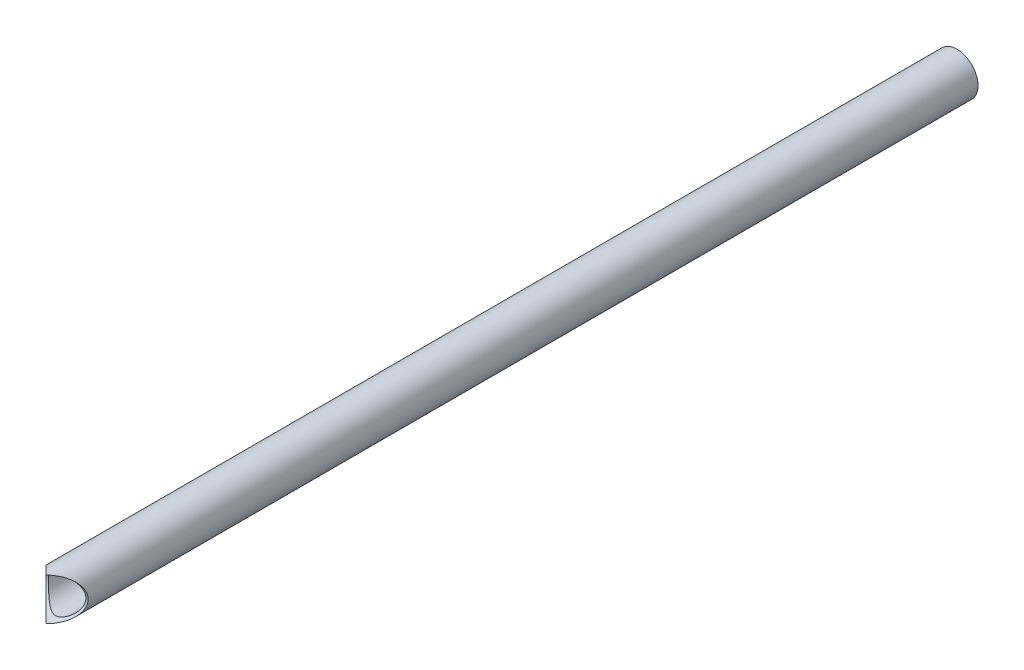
ISO-10303-21;
HEADER;
FILE_DESCRIPTION(('STEP AP214'),'2;1');
FILE_NAME('part.step','',(''),(''),'','','');
FILE_SCHEMA(('AUTOMOTIVE_DESIGN { 1 0 10303 214 1 1 1 1 }'));
ENDSEC;
DATA;
#1=APPLICATION_CONTEXT('core data for automotive mechanical design processes');
#2=APPLICATION_PROTOCOL_DEFINITION('international standard','automotive_design',2000,#1);
#3=PRODUCT_CONTEXT('',#1,'mechanical');
#4=PRODUCT('Part','Part','',(#3));
#5=PRODUCT_RELATED_PRODUCT_CATEGORY('part','',(#4));
#6=PRODUCT_DEFINITION_FORMATION('','',#4);
#7=PRODUCT_DEFINITION_CONTEXT('part definition',#1,'design');
#8=PRODUCT_DEFINITION('design','',#6,#7);
#9=PRODUCT_DEFINITION_SHAPE('','',#8);
#10=(LENGTH_UNIT() NAMED_UNIT(*) SI_UNIT(.MILLI.,.METRE.));
#11=(NAMED_UNIT(*) PLANE_ANGLE_UNIT() SI_UNIT($,.RADIAN.));
#12=(NAMED_UNIT(*) SI_UNIT($,.STERADIAN.) SOLID_ANGLE_UNIT());
#13=UNCERTAINTY_MEASURE_WITH_UNIT(LENGTH_MEASURE(1.E-05),#10,'distance_accuracy_value','');
#14=(GEOMETRIC_REPRESENTATION_CONTEXT(3) GLOBAL_UNCERTAINTY_ASSIGNED_CONTEXT((#13)) GLOBAL_UNIT_ASSIGNED_CONTEXT((#10,
#11,#12)) REPRESENTATION_CONTEXT('',''));
#15=CARTESIAN_POINT('',(0.,0.,0.));
#16=DIRECTION('',(0.,0.,1.));
#17=DIRECTION('',(1.,0.,0.));
#18=AXIS2_PLACEMENT_3D('',#15,#16,#17);
#19=CARTESIAN_POINT('',(-193.,0.,-531.999));
#20=DIRECTION('',(0.,0.,-1.));
#21=DIRECTION('',(-1.,0.,0.));
#22=AXIS2_PLACEMENT_3D('',#19,#20,#21);
#23=CYLINDRICAL_SURFACE('',#22,14.);
#24=CARTESIAN_POINT('',(-193.,0.,-546.));
#25=DIRECTION('',(0.707106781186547,0.,-0.707106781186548));
#26=DIRECTION('',(-0.707106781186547,0.,-0.707106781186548));
#27=AXIS2_PLACEMENT_3D('',#24,#25,#26);
#28=ELLIPSE('',#27,19.7989898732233,14.);
#29=CARTESIAN_POINT('',(-193.,14.,-546.));
#30=VERTEX_POINT('',#29);
#31=CARTESIAN_POINT('',(-193.,-14.,-546.));
#32=VERTEX_POINT('',#31);
#33=EDGE_CURVE('E42',#30,#32,#28,.F.);
#34=ORIENTED_EDGE('',*,*,#33,.F.);
#35=CARTESIAN_POINT('',(-193.,0.,-546.));
#36=DIRECTION('',(-0.707106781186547,0.,-0.707106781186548));
#37=DIRECTION('',(0.707106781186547,0.,-0.707106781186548));
#38=AXIS2_PLACEMENT_3D('',#35,#36,#37);
#39=ELLIPSE('',#38,19.7989898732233,14.);
#40=EDGE_CURVE('E11',#32,#30,#39,.F.);
#41=ORIENTED_EDGE('',*,*,#40,.F.);
#42=EDGE_LOOP('',(#34,#41));
#43=FACE_BOUND('',#42,.T.);
#44=CARTESIAN_POINT('',(-193.,0.,-1151.));
#45=DIRECTION('',(0.,0.,-1.));
#46=DIRECTION('',(-1.,0.,0.));
#47=AXIS2_PLACEMENT_3D('',#44,#45,#46);
#48=CIRCLE('',#47,14.);
#49=CARTESIAN_POINT('',(-207.,0.,-1151.));
#50=VERTEX_POINT('',#49);
#51=EDGE_CURVE('E55',#50,#50,#48,.T.);
#52=ORIENTED_EDGE('',*,*,#51,.F.);
#53=EDGE_LOOP('',(#52));
#54=FACE_BOUND('',#53,.T.);
#55=ADVANCED_FACE('F32',(#43,#54),#23,.T.);
#56=CARTESIAN_POINT('',(-193.,0.,-531.999));
#57=DIRECTION('',(0.,0.,-1.));
#58=DIRECTION('',(-1.,0.,0.));
#59=AXIS2_PLACEMENT_3D('',#56,#57,#58);
#60=CYLINDRICAL_SURFACE('',#59,12.5);
#61=CARTESIAN_POINT('',(-205.5,0.,-560.));
#62=CARTESIAN_POINT('',(-205.500002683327,-0.290426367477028,-560.000002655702));
#63=CARTESIAN_POINT('',(-205.489862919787,-0.580822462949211,-559.990946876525));
#64=CARTESIAN_POINT('',(-205.449509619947,-1.15920550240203,-559.954934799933));
#65=CARTESIAN_POINT('',(-205.419289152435,-1.44719157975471,-559.927972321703));
#66=CARTESIAN_POINT('',(-205.339308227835,-2.01862087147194,-559.856702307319));
#67=CARTESIAN_POINT('',(-205.289522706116,-2.30205777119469,-559.812372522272));
#68=CARTESIAN_POINT('',(-205.171338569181,-2.86188119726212,-559.707324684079));
#69=CARTESIAN_POINT('',(-205.102941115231,-3.13826816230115,-559.646607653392));
#70=CARTESIAN_POINT('',(-204.949197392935,-3.68042940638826,-559.51044238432));
#71=CARTESIAN_POINT('',(-204.863967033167,-3.94626210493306,-559.435094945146));
#72=CARTESIAN_POINT('',(-204.677532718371,-4.46788012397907,-559.270751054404));
#73=CARTESIAN_POINT('',(-204.576328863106,-4.72366550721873,-559.181754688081));
#74=CARTESIAN_POINT('',(-204.359240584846,-5.22418119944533,-558.991520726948));
#75=CARTESIAN_POINT('',(-204.243356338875,-5.46891164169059,-558.890283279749));
#76=CARTESIAN_POINT('',(-203.998151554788,-5.94666222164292,-558.676974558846));
#77=CARTESIAN_POINT('',(-203.868828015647,-6.17967972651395,-558.564900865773));
#78=CARTESIAN_POINT('',(-203.544530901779,-6.72299041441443,-558.285274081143));
#79=CARTESIAN_POINT('',(-203.343767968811,-7.02755432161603,-558.113260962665));
#80=CARTESIAN_POINT('',(-202.921214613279,-7.61247576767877,-557.754489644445));
#81=CARTESIAN_POINT('',(-202.69941650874,-7.89282439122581,-557.567726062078));
#82=CARTESIAN_POINT('',(-202.236586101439,-8.4297919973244,-557.182487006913));
#83=CARTESIAN_POINT('',(-201.995512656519,-8.68635755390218,-556.983986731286));
#84=CARTESIAN_POINT('',(-201.49627804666,-9.17525653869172,-556.579008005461));
#85=CARTESIAN_POINT('',(-201.238119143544,-9.40759316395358,-556.372530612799));
#86=CARTESIAN_POINT('',(-200.699647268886,-9.85344692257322,-555.950175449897));
#87=CARTESIAN_POINT('',(-200.418963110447,-10.0664134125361,-555.734190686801));
#88=CARTESIAN_POINT('',(-199.841064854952,-10.4677435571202,-555.301260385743));
#89=CARTESIAN_POINT('',(-199.543846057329,-10.6561001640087,-555.084314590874));
#90=CARTESIAN_POINT('',(-198.933038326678,-11.0078643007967,-554.654700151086));
#91=CARTESIAN_POINT('',(-198.619480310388,-11.1713168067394,-554.44202441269));
#92=CARTESIAN_POINT('',(-197.974194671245,-11.4731979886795,-554.026914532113));
#93=CARTESIAN_POINT('',(-197.642479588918,-11.6116436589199,-553.824473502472));
#94=CARTESIAN_POINT('',(-197.128501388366,-11.7999538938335,-553.534887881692));
#95=CARTESIAN_POINT('',(-196.953925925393,-11.8596381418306,-553.440459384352));
#96=CARTESIAN_POINT('',(-196.599211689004,-11.972065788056,-553.258176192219));
#97=CARTESIAN_POINT('',(-196.419072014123,-12.0248080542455,-553.170322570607));
#98=CARTESIAN_POINT('',(-195.870033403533,-12.1719422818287,-552.919616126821));
#99=CARTESIAN_POINT('',(-195.491918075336,-12.2554639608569,-552.76926709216));
#100=CARTESIAN_POINT('',(-194.940068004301,-12.3496272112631,-552.594710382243));
#101=CARTESIAN_POINT('',(-194.775680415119,-12.3743714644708,-552.548060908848));
#102=CARTESIAN_POINT('',(-194.443364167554,-12.4175173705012,-552.465864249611));
#103=CARTESIAN_POINT('',(-194.275437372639,-12.4359222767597,-552.430311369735));
#104=CARTESIAN_POINT('',(-193.93709541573,-12.4659792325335,-552.371848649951));
#105=CARTESIAN_POINT('',(-193.766685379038,-12.4776435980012,-552.348915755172));
#106=CARTESIAN_POINT('',(-193.424230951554,-12.4939746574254,-552.316718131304));
#107=CARTESIAN_POINT('',(-193.252186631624,-12.4986416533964,-552.307452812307));
#108=CARTESIAN_POINT('',(-192.907247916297,-12.5008499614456,-552.303075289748));
#109=CARTESIAN_POINT('',(-192.734352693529,-12.4983655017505,-552.308014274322));
#110=CARTESIAN_POINT('',(-192.389793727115,-12.4862873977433,-552.331887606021));
#111=CARTESIAN_POINT('',(-192.218130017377,-12.476693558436,-552.35082233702));
#112=CARTESIAN_POINT('',(-191.877005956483,-12.450630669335,-552.401765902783));
#113=CARTESIAN_POINT('',(-191.707549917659,-12.4341497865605,-552.433797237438));
#114=CARTESIAN_POINT('',(-191.372008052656,-12.3946846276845,-552.509501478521));
#115=CARTESIAN_POINT('',(-191.205923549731,-12.3716978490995,-552.553178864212));
#116=CARTESIAN_POINT('',(-190.798152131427,-12.3070190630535,-552.67412751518));
#117=CARTESIAN_POINT('',(-190.558830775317,-12.2616606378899,-552.757421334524));
#118=CARTESIAN_POINT('',(-190.08942426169,-12.1587985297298,-552.940796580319));
#119=CARTESIAN_POINT('',(-189.859344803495,-12.1012874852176,-553.040888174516));
#120=CARTESIAN_POINT('',(-189.407388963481,-11.9749067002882,-553.25375675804));
#121=CARTESIAN_POINT('',(-189.185544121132,-11.9059978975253,-553.366576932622));
#122=CARTESIAN_POINT('',(-188.750297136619,-11.7576734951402,-553.601076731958));
#123=CARTESIAN_POINT('',(-188.536894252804,-11.6782588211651,-553.722755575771));
#124=CARTESIAN_POINT('',(-188.140559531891,-11.5185240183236,-553.958747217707));
#125=CARTESIAN_POINT('',(-187.956832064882,-11.4392350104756,-554.072428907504));
#126=CARTESIAN_POINT('',(-187.595134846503,-11.2728455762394,-554.303205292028));
#127=CARTESIAN_POINT('',(-187.417165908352,-11.1857440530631,-554.420300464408));
#128=CARTESIAN_POINT('',(-186.891240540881,-10.9128047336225,-554.774938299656));
#129=CARTESIAN_POINT('',(-186.551407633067,-10.7153898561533,-555.01574637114));
#130=CARTESIAN_POINT('',(-185.892421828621,-10.2900913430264,-555.498295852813));
#131=CARTESIAN_POINT('',(-185.573262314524,-10.0622175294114,-555.740036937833));
#132=CARTESIAN_POINT('',(-184.955687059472,-9.57566913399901,-556.218755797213));
#133=CARTESIAN_POINT('',(-184.657262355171,-9.31700799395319,-556.455735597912));
#134=CARTESIAN_POINT('',(-184.132840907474,-8.81650601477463,-556.879203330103));
#135=CARTESIAN_POINT('',(-183.903321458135,-8.57967281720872,-557.067256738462));
#136=CARTESIAN_POINT('',(-183.460506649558,-8.08445323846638,-557.434007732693));
#137=CARTESIAN_POINT('',(-183.247211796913,-7.8260661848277,-557.612705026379));
#138=CARTESIAN_POINT('',(-182.838977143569,-7.28816980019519,-557.957612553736));
#139=CARTESIAN_POINT('',(-182.644007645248,-7.0086960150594,-558.123842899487));
#140=CARTESIAN_POINT('',(-182.274259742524,-6.42858608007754,-558.441161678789));
#141=CARTESIAN_POINT('',(-182.099476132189,-6.12795541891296,-558.592254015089));
#142=CARTESIAN_POINT('',(-181.808062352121,-5.57370754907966,-558.845445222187));
#143=CARTESIAN_POINT('',(-181.687034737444,-5.32400446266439,-558.951068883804));
#144=CARTESIAN_POINT('',(-181.460312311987,-4.8128714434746,-559.149577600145));
#145=CARTESIAN_POINT('',(-181.354614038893,-4.55144417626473,-559.242465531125));
#146=CARTESIAN_POINT('',(-181.159956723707,-4.01795566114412,-559.413966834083));
#147=CARTESIAN_POINT('',(-181.070992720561,-3.74589759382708,-559.492584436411));
#148=CARTESIAN_POINT('',(-180.911128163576,-3.19250876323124,-559.634127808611));
#149=CARTESIAN_POINT('',(-180.840227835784,-2.9111778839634,-559.697053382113));
#150=CARTESIAN_POINT('',(-180.717300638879,-2.3391163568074,-559.80629939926));
#151=CARTESIAN_POINT('',(-180.665408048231,-2.04833405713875,-559.852501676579));
#152=CARTESIAN_POINT('',(-180.582199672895,-1.46152013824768,-559.926643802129));
#153=CARTESIAN_POINT('',(-180.550883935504,-1.16548850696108,-559.954583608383));
#154=CARTESIAN_POINT('',(-180.509488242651,-0.57087670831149,-559.991525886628));
#155=CARTESIAN_POINT('',(-180.499400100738,-0.272297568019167,-560.00053565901));
#156=CARTESIAN_POINT('',(-180.500654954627,0.324764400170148,-559.999415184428));
#157=CARTESIAN_POINT('',(-180.511996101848,0.623247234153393,-559.989286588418));
#158=CARTESIAN_POINT('',(-180.553459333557,1.18493817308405,-559.952286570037));
#159=CARTESIAN_POINT('',(-180.581397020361,1.44844139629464,-559.927362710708));
#160=CARTESIAN_POINT('',(-180.653610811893,1.97137774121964,-559.863010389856));
#161=CARTESIAN_POINT('',(-180.697885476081,2.23081121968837,-559.823583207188));
#162=CARTESIAN_POINT('',(-180.802091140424,2.74401080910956,-559.730929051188));
#163=CARTESIAN_POINT('',(-180.862023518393,2.99777641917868,-559.677700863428));
#164=CARTESIAN_POINT('',(-180.996688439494,3.49823864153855,-559.558337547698));
#165=CARTESIAN_POINT('',(-181.071421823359,3.74493485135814,-559.492201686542));
#166=CARTESIAN_POINT('',(-181.237757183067,4.23911744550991,-559.345365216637));
#167=CARTESIAN_POINT('',(-181.329882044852,4.48629370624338,-559.264215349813));
#168=CARTESIAN_POINT('',(-181.527928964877,4.97093045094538,-559.090308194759));
#169=CARTESIAN_POINT('',(-181.633856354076,5.20838713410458,-558.997546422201));
#170=CARTESIAN_POINT('',(-181.858363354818,5.67278129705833,-558.801681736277));
#171=CARTESIAN_POINT('',(-181.976942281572,5.89971934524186,-558.698579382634));
#172=CARTESIAN_POINT('',(-182.22571298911,6.34265635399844,-558.483244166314));
#173=CARTESIAN_POINT('',(-182.355907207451,6.55865300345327,-558.371009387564));
#174=CARTESIAN_POINT('',(-182.695608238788,7.0860184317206,-558.079711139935));
#175=CARTESIAN_POINT('',(-182.911883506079,7.39027375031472,-557.89559462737));
#176=CARTESIAN_POINT('',(-183.365753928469,7.97294254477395,-557.51319827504));
#177=CARTESIAN_POINT('',(-183.603358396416,8.251344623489,-557.314912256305));
#178=CARTESIAN_POINT('',(-184.09838426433,8.78314332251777,-556.907288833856));
#179=CARTESIAN_POINT('',(-184.355863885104,9.03646110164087,-556.697919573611));
#180=CARTESIAN_POINT('',(-184.888411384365,9.51739803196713,-556.272400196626));
#181=CARTESIAN_POINT('',(-185.163476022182,9.74502189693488,-556.05625133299));
#182=CARTESIAN_POINT('',(-185.736980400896,10.1799336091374,-555.615967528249));
#183=CARTESIAN_POINT('',(-186.035811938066,10.3866342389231,-555.391763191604));
#184=CARTESIAN_POINT('',(-186.651306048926,10.7738755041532,-554.944889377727));
#185=CARTESIAN_POINT('',(-186.96797687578,10.9544038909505,-554.722220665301));
#186=CARTESIAN_POINT('',(-187.619271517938,11.2885523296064,-554.285157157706));
#187=CARTESIAN_POINT('',(-187.953840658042,11.4422488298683,-554.070740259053));
#188=CARTESIAN_POINT('',(-188.471177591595,11.6522223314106,-553.761528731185));
#189=CARTESIAN_POINT('',(-188.646140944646,11.7187656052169,-553.660559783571));
#190=CARTESIAN_POINT('',(-189.001652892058,11.8447793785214,-553.464232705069));
#191=CARTESIAN_POINT('',(-189.182200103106,11.9042516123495,-553.368873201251));
#192=CARTESIAN_POINT('',(-189.53253720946,12.0107071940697,-553.19391632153));
#193=CARTESIAN_POINT('',(-189.701807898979,12.0583347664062,-553.11367448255));
#194=CARTESIAN_POINT('',(-190.045542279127,12.1471268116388,-552.960970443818));
#195=CARTESIAN_POINT('',(-190.220006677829,12.1882903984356,-552.888509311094));
#196=CARTESIAN_POINT('',(-190.573866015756,12.2636264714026,-552.753475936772));
#197=CARTESIAN_POINT('',(-190.753251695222,12.2978111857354,-552.690886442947));
#198=CARTESIAN_POINT('',(-191.116946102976,12.3587241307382,-552.577695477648));
#199=CARTESIAN_POINT('',(-191.301251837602,12.385456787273,-552.527086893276));
#200=CARTESIAN_POINT('',(-191.647288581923,12.4276310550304,-552.446375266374));
#201=CARTESIAN_POINT('',(-191.808442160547,12.4441450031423,-552.414367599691));
#202=CARTESIAN_POINT('',(-192.13310080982,12.4709659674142,-552.362065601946));
#203=CARTESIAN_POINT('',(-192.296604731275,12.4812759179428,-552.341765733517));
#204=CARTESIAN_POINT('',(-192.624855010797,12.4954482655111,-552.313796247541));
#205=CARTESIAN_POINT('',(-192.789600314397,12.4993156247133,-552.30611690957));
#206=CARTESIAN_POINT('',(-193.11921193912,12.5005180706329,-552.303733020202));
#207=CARTESIAN_POINT('',(-193.284078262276,12.4978530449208,-552.309028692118));
#208=CARTESIAN_POINT('',(-193.612291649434,12.4860722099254,-552.332311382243));
#209=CARTESIAN_POINT('',(-193.775641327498,12.4769711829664,-552.350269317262));
#210=CARTESIAN_POINT('',(-194.100158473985,12.4525569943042,-552.39800997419));
#211=CARTESIAN_POINT('',(-194.261324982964,12.4372411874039,-552.427797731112));
#212=CARTESIAN_POINT('',(-194.740651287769,12.3823862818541,-552.533208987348));
#213=CARTESIAN_POINT('',(-195.054350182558,12.3339508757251,-552.624856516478));
#214=CARTESIAN_POINT('',(-195.627559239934,12.2237604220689,-552.82575993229));
#215=CARTESIAN_POINT('',(-195.888912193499,12.1644574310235,-552.931334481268));
#216=CARTESIAN_POINT('',(-196.400398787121,12.0315043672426,-553.159635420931));
#217=CARTESIAN_POINT('',(-196.650523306,11.9578428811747,-553.282375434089));
#218=CARTESIAN_POINT('',(-197.141022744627,11.7969842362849,-553.540181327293));
#219=CARTESIAN_POINT('',(-197.381357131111,11.7097368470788,-553.675292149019));
#220=CARTESIAN_POINT('',(-197.852173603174,11.522609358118,-553.95346627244));
#221=CARTESIAN_POINT('',(-198.082657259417,11.4227312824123,-554.096528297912));
#222=CARTESIAN_POINT('',(-198.68113154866,11.1420018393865,-554.481959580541));
#223=CARTESIAN_POINT('',(-199.04146035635,10.9506145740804,-554.728615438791));
#224=CARTESIAN_POINT('',(-199.739997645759,10.5350627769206,-555.225929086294));
#225=CARTESIAN_POINT('',(-200.078192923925,10.3108789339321,-555.476589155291));
#226=CARTESIAN_POINT('',(-200.732233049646,9.82990761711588,-555.974598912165));
#227=CARTESIAN_POINT('',(-201.048107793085,9.57316509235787,-556.221952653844));
#228=CARTESIAN_POINT('',(-201.6568462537,9.02641851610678,-556.707822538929));
#229=CARTESIAN_POINT('',(-201.949721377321,8.7364311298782,-556.946343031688));
#230=CARTESIAN_POINT('',(-202.439440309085,8.20020867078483,-557.350733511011));
#231=CARTESIAN_POINT('',(-202.641860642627,7.96141219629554,-557.519741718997));
#232=CARTESIAN_POINT('',(-203.031221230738,7.46485921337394,-557.847546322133));
#233=CARTESIAN_POINT('',(-203.218161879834,7.20710318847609,-558.006342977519));
#234=CARTESIAN_POINT('',(-203.574616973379,6.67311106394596,-558.311133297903));
#235=CARTESIAN_POINT('',(-203.744150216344,6.39689544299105,-558.457140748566));
#236=CARTESIAN_POINT('',(-204.063954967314,5.82630169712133,-558.733997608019));
#237=CARTESIAN_POINT('',(-204.214230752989,5.53192762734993,-558.864850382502));
#238=CARTESIAN_POINT('',(-204.467176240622,4.98271227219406,-559.085988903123));
#239=CARTESIAN_POINT('',(-204.573494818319,4.73075971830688,-559.179286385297));
#240=CARTESIAN_POINT('',(-204.770602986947,4.21647994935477,-559.352711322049));
#241=CARTESIAN_POINT('',(-204.861395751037,3.95415486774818,-559.43284146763));
#242=CARTESIAN_POINT('',(-205.026068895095,3.42073720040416,-559.578470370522));
#243=CARTESIAN_POINT('',(-205.099975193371,3.14965878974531,-559.643991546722));
#244=CARTESIAN_POINT('',(-205.229858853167,2.60005209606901,-559.759307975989));
#245=CARTESIAN_POINT('',(-205.285842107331,2.32152629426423,-559.809108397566));
#246=CARTESIAN_POINT('',(-205.38773251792,1.7055816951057,-559.899829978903));
#247=CARTESIAN_POINT('',(-205.429730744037,1.36698843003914,-559.937289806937));
#248=CARTESIAN_POINT('',(-205.485865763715,0.685583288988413,-559.987375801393));
#249=CARTESIAN_POINT('',(-205.499996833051,0.342770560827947,-559.999996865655));
#250=CARTESIAN_POINT('',(-205.5,0.,-560.));
#251=B_SPLINE_CURVE_WITH_KNOTS('',3,(#61,#62,#63,#64,#65,#66,#67,#68,#69,#70,#71,#72,#73,#74,
#75,#76,#77,#78,#79,#80,#81,#82,#83,#84,#85,#86,#87,#88,#89,#90,#91,#92,#93,#94,#95,#96,#97,#98,
#99,#100,#101,#102,#103,#104,#105,#106,#107,#108,#109,#110,#111,#112,#113,#114,#115,#116,#117,
#118,#119,#120,#121,#122,#123,#124,#125,#126,#127,#128,#129,#130,#131,#132,#133,#134,#135,#136,
#137,#138,#139,#140,#141,#142,#143,#144,#145,#146,#147,#148,#149,#150,#151,#152,#153,#154,#155,
#156,#157,#158,#159,#160,#161,#162,#163,#164,#165,#166,#167,#168,#169,#170,#171,#172,#173,#174,
#175,#176,#177,#178,#179,#180,#181,#182,#183,#184,#185,#186,#187,#188,#189,#190,#191,#192,#193,
#194,#195,#196,#197,#198,#199,#200,#201,#202,#203,#204,#205,#206,#207,#208,#209,#210,#211,#212,
#213,#214,#215,#216,#217,#218,#219,#220,#221,#222,#223,#224,#225,#226,#227,#228,#229,#230,#231,
#232,#233,#234,#235,#236,#237,#238,#239,#240,#241,#242,#243,#244,#245,#246,#247,#248,#249,#250),
.UNSPECIFIED.,.T.,.F.,(4,2,2,2,2,2,2,2,2,2,2,2,2,2,2,2,2,2,2,2,2,2,2,2,2,2,2,2,2,2,2,2,2,2,2,2,
2,2,2,2,2,2,2,2,2,2,2,2,2,2,2,2,2,2,2,2,2,2,2,2,2,2,2,2,2,2,2,2,2,2,2,2,2,2,2,2,2,2,2,2,2,2,2,2,
2,2,2,2,2,2,2,2,2,2,4),(0.,0.870912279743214,1.7421253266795,2.61445813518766,3.48673652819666,
4.35320575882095,5.21966957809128,6.08612295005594,6.95277022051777,8.16090249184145,
9.36947768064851,10.5807051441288,11.791772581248,13.0304845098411,14.269550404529,
15.5063513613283,16.7423086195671,17.3637986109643,17.9853898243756,19.2264014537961,
19.7439883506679,20.2613092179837,20.7776818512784,21.2940321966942,21.8122456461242,
22.3304733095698,22.8495950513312,23.3689167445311,24.1398997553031,24.911351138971,
25.68550340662,26.4595875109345,27.1497693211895,27.8400481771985,29.2211329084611,
30.6017733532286,31.9818132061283,33.1197908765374,34.2578040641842,35.3939400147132,
36.5297822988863,37.4196969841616,38.3094103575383,39.1988595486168,40.0883198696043,
40.9839477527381,41.8795776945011,42.774862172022,43.6700694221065,44.4675924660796,
45.2650452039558,46.0625681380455,46.8601363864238,47.6872891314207,48.5147623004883,
49.3421907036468,50.1697931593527,51.4166243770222,52.6640026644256,53.9151847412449,
55.1661369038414,56.4458234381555,57.7261069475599,59.0026809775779,59.6405294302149,
60.2782211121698,60.8577961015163,61.437450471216,62.0160803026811,62.5943657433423,
63.0892563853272,63.5839127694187,64.0781879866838,64.5724717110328,65.0656238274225,
65.558986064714,66.546567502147,67.4095272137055,68.273175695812,69.1400966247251,
70.0068788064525,71.4352569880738,72.8644796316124,74.2917502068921,75.7183084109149,
76.784694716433,77.8510538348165,78.9162489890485,79.9812071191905,80.8472084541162,
81.7130325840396,82.5775187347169,83.4417203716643,84.4693880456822,85.4972667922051),.UNSPECIFIED.);
#252=CARTESIAN_POINT('',(-205.5,0.,-560.));
#253=VERTEX_POINT('',#252);
#254=EDGE_CURVE('E49',#253,#253,#251,.T.);
#255=ORIENTED_EDGE('',*,*,#254,.T.);
#256=EDGE_LOOP('',(#255));
#257=FACE_BOUND('',#256,.T.);
#258=CARTESIAN_POINT('',(-193.,0.,-1151.));
#259=DIRECTION('',(0.,0.,-1.));
#260=DIRECTION('',(-1.,0.,0.));
#261=AXIS2_PLACEMENT_3D('',#258,#259,#260);
#262=CIRCLE('',#261,12.5);
#263=CARTESIAN_POINT('',(-205.5,0.,-1151.));
#264=VERTEX_POINT('',#263);
#265=EDGE_CURVE('E57',#264,#264,#262,.T.);
#266=ORIENTED_EDGE('',*,*,#265,.T.);
#267=EDGE_LOOP('',(#266));
#268=FACE_BOUND('',#267,.T.);
#269=ADVANCED_FACE('F52',(#257,#268),#60,.F.);
#270=CARTESIAN_POINT('',(-283.754035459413,0.,-546.));
#271=DIRECTION('',(1.,0.,0.));
#272=DIRECTION('',(0.,0.,-1.));
#273=AXIS2_PLACEMENT_3D('',#270,#271,#272);
#274=CYLINDRICAL_SURFACE('',#273,14.);
#275=ORIENTED_EDGE('',*,*,#33,.T.);
#276=ORIENTED_EDGE('',*,*,#40,.T.);
#277=EDGE_LOOP('',(#275,#276));
#278=FACE_BOUND('',#277,.T.);
#279=ORIENTED_EDGE('',*,*,#254,.F.);
#280=EDGE_LOOP('',(#279));
#281=FACE_BOUND('',#280,.T.);
#282=ADVANCED_FACE('F34',(#278,#281),#274,.F.);
#283=CARTESIAN_POINT('',(-193.,0.,-1151.));
#284=DIRECTION('',(0.,0.,-1.));
#285=DIRECTION('',(-1.,0.,0.));
#286=AXIS2_PLACEMENT_3D('',#283,#284,#285);
#287=PLANE('',#286);
#288=ORIENTED_EDGE('',*,*,#51,.T.);
#289=EDGE_LOOP('',(#288));
#290=FACE_BOUND('',#289,.T.);
#291=ORIENTED_EDGE('',*,*,#265,.F.);
#292=EDGE_LOOP('',(#291));
#293=FACE_BOUND('',#292,.T.);
#294=ADVANCED_FACE('F70',(#290,#293),#287,.T.);
#295=CLOSED_SHELL('',(#55,#269,#282,#294));
#296=MANIFOLD_SOLID_BREP('B2',#295);
#297=ADVANCED_BREP_SHAPE_REPRESENTATION('',(#18,#296),#14);
#298=SHAPE_DEFINITION_REPRESENTATION(#9,#297);
ENDSEC;
END-ISO-10303-21;
